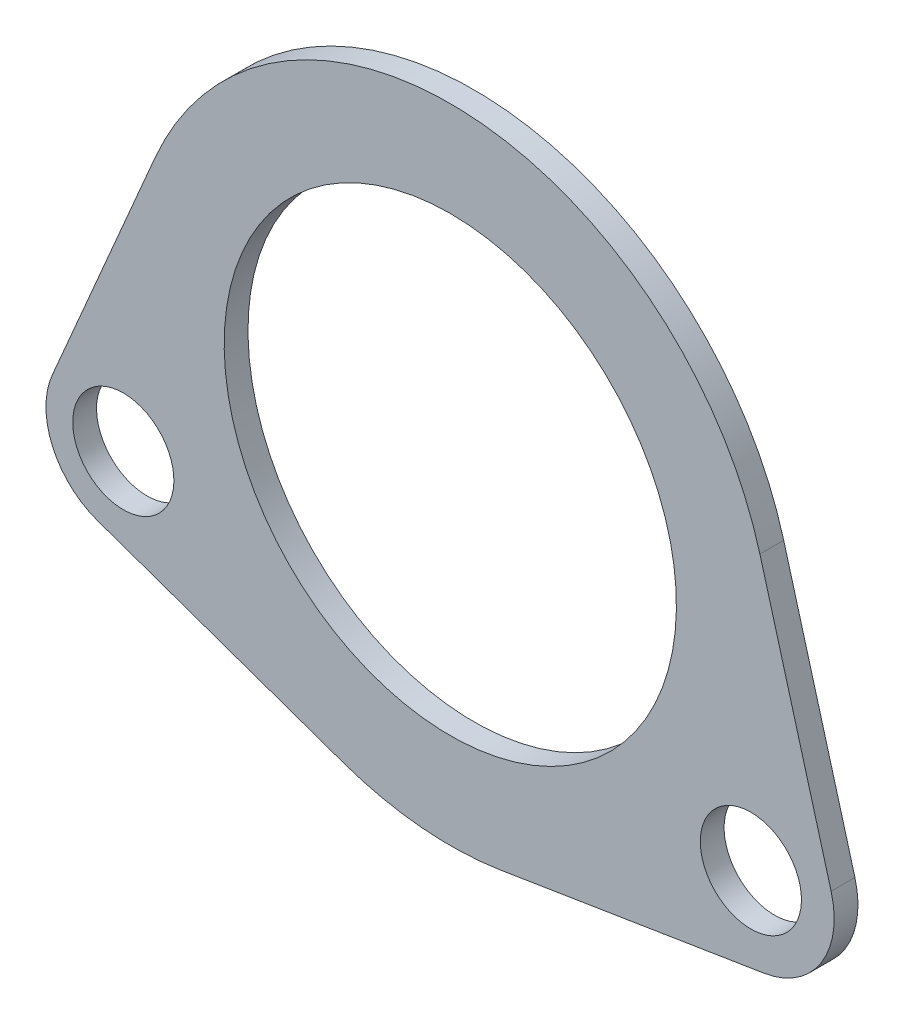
from build123d import *

# Parameters (mm, degrees)
ESQUISSE3_R      = 4.25
ESQUISSE3_R_2    = 19
EXTRUSION1_DEPTH = 2


with BuildPart() as part:
    # Esquisse3 → Extrusion1 (new body)
    with BuildSketch(Plane(origin=(0, 0, 36.368539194), x_dir=(-1, 0, 0), z_dir=(0, 0, -1))):
        with BuildLine():
            Line((-34.546404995, -4.646910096), (-28.561354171, 16.897907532))
            ThreePointArc((-28.561354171, 16.897907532), (-4.357935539, 36.610263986), (22.266665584, 20.315691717))
            Line((22.266665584, 20.315691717), (30.901873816, 0.18652932))
            ThreePointArc((30.901873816, 0.18652932), (30.881215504, -4.986275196), (27.090400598, -8.505942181))
            Line((27.090400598, -8.505942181), (6.434392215, -15.791497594))
            ThreePointArc((6.434392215, -15.791497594), (-0.126977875, -17.220275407), (-6.838009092, -16.985661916))
            Line((-6.838009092, -16.985661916), (-28.914426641, -13.431539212))
            ThreePointArc((-28.914426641, -13.431539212), (-33.694718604, -10.298573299), (-34.546404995, -4.646910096))
        make_face()
        with Locations(Location((-27.801810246, -6.520527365, 0), (0, 0, 90))):
            Circle(ESQUISSE3_R, mode=Mode.SUBTRACT)
        with Locations(Location((-2.54648871, 9.671098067, 0), (0, 0, 90))):
            Circle(ESQUISSE3_R_2, mode=Mode.SUBTRACT)
        with Locations(Location((24.928336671, -2.37605804, 0), (0, 0, 90))):
            Circle(ESQUISSE3_R, mode=Mode.SUBTRACT)
    extrude(amount=EXTRUSION1_DEPTH)


solid = part.part
